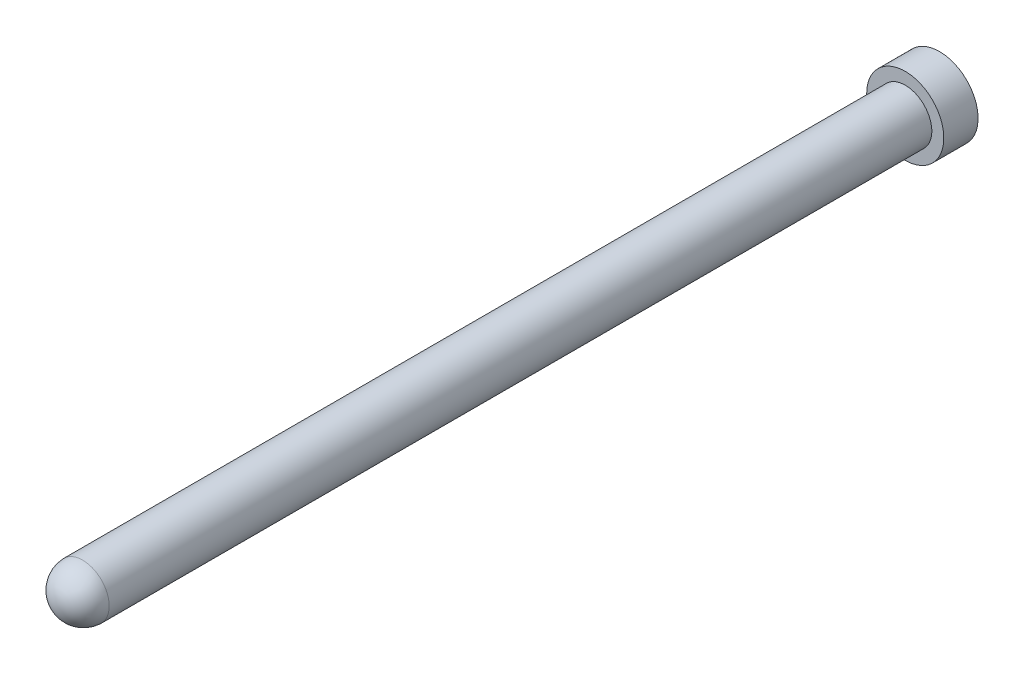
ISO-10303-21;
HEADER;
FILE_DESCRIPTION(('STEP AP214'),'2;1');
FILE_NAME('part.step','',(''),(''),'','','');
FILE_SCHEMA(('AUTOMOTIVE_DESIGN { 1 0 10303 214 1 1 1 1 }'));
ENDSEC;
DATA;
#1=APPLICATION_CONTEXT('core data for automotive mechanical design processes');
#2=APPLICATION_PROTOCOL_DEFINITION('international standard','automotive_design',2000,#1);
#3=PRODUCT_CONTEXT('',#1,'mechanical');
#4=PRODUCT('Part','Part','',(#3));
#5=PRODUCT_RELATED_PRODUCT_CATEGORY('part','',(#4));
#6=PRODUCT_DEFINITION_FORMATION('','',#4);
#7=PRODUCT_DEFINITION_CONTEXT('part definition',#1,'design');
#8=PRODUCT_DEFINITION('design','',#6,#7);
#9=PRODUCT_DEFINITION_SHAPE('','',#8);
#10=(LENGTH_UNIT() NAMED_UNIT(*) SI_UNIT(.MILLI.,.METRE.));
#11=(NAMED_UNIT(*) PLANE_ANGLE_UNIT() SI_UNIT($,.RADIAN.));
#12=(NAMED_UNIT(*) SI_UNIT($,.STERADIAN.) SOLID_ANGLE_UNIT());
#13=UNCERTAINTY_MEASURE_WITH_UNIT(LENGTH_MEASURE(1.E-05),#10,'distance_accuracy_value','');
#14=(GEOMETRIC_REPRESENTATION_CONTEXT(3) GLOBAL_UNCERTAINTY_ASSIGNED_CONTEXT((#13)) GLOBAL_UNIT_ASSIGNED_CONTEXT((#10,
#11,#12)) REPRESENTATION_CONTEXT('',''));
#15=CARTESIAN_POINT('',(0.,0.,0.));
#16=DIRECTION('',(0.,0.,1.));
#17=DIRECTION('',(1.,0.,0.));
#18=AXIS2_PLACEMENT_3D('',#15,#16,#17);
#19=CARTESIAN_POINT('',(0.,0.,100.));
#20=DIRECTION('',(0.,0.,-1.));
#21=DIRECTION('',(-1.00000000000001,0.,0.));
#22=AXIS2_PLACEMENT_3D('',#19,#20,#21);
#23=CYLINDRICAL_SURFACE('',#22,3.1);
#24=CARTESIAN_POINT('',(0.,0.,100.));
#25=DIRECTION('',(0.,0.,1.));
#26=DIRECTION('',(1.00000000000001,0.,0.));
#27=AXIS2_PLACEMENT_3D('',#24,#25,#26);
#28=CIRCLE('',#27,3.1);
#29=CARTESIAN_POINT('',(3.10000000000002,0.,100.));
#30=VERTEX_POINT('',#29);
#31=EDGE_CURVE('E35',#30,#30,#28,.T.);
#32=ORIENTED_EDGE('',*,*,#31,.F.);
#33=EDGE_LOOP('',(#32));
#34=FACE_BOUND('',#33,.T.);
#35=CARTESIAN_POINT('',(0.,0.,4.));
#36=DIRECTION('',(0.,0.,-1.));
#37=DIRECTION('',(-1.00000000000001,0.,0.));
#38=AXIS2_PLACEMENT_3D('',#35,#36,#37);
#39=CIRCLE('',#38,3.1);
#40=CARTESIAN_POINT('',(-3.10000000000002,0.,4.));
#41=VERTEX_POINT('',#40);
#42=EDGE_CURVE('E10',#41,#41,#39,.T.);
#43=ORIENTED_EDGE('',*,*,#42,.F.);
#44=EDGE_LOOP('',(#43));
#45=FACE_BOUND('',#44,.T.);
#46=ADVANCED_FACE('F31',(#34,#45),#23,.T.);
#47=CARTESIAN_POINT('',(0.,0.,99.8983333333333));
#48=DIRECTION('',(0.,0.,1.));
#49=DIRECTION('',(1.00000000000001,0.,0.));
#50=AXIS2_PLACEMENT_3D('',#47,#48,#49);
#51=SPHERICAL_SURFACE('',#50,3.10166666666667);
#52=ORIENTED_EDGE('',*,*,#31,.T.);
#53=EDGE_LOOP('',(#52));
#54=FACE_BOUND('',#53,.T.);
#55=ADVANCED_FACE('F33',(#54),#51,.T.);
#56=CARTESIAN_POINT('',(0.,0.,4.));
#57=DIRECTION('',(0.,0.,-1.));
#58=DIRECTION('',(-1.00000000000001,0.,0.));
#59=AXIS2_PLACEMENT_3D('',#56,#57,#58);
#60=PLANE('',#59);
#61=CARTESIAN_POINT('',(0.,0.,4.));
#62=DIRECTION('',(0.,0.,-1.));
#63=DIRECTION('',(-1.00000000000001,0.,0.));
#64=AXIS2_PLACEMENT_3D('',#61,#62,#63);
#65=CIRCLE('',#64,4.5);
#66=CARTESIAN_POINT('',(-4.50000000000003,0.,4.));
#67=VERTEX_POINT('',#66);
#68=EDGE_CURVE('E42',#67,#67,#65,.T.);
#69=ORIENTED_EDGE('',*,*,#68,.F.);
#70=EDGE_LOOP('',(#69));
#71=FACE_BOUND('',#70,.T.);
#72=ORIENTED_EDGE('',*,*,#42,.T.);
#73=EDGE_LOOP('',(#72));
#74=FACE_BOUND('',#73,.T.);
#75=ADVANCED_FACE('F54',(#71,#74),#60,.F.);
#76=CARTESIAN_POINT('',(0.,0.,4.));
#77=DIRECTION('',(0.,0.,-1.));
#78=DIRECTION('',(-1.00000000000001,0.,0.));
#79=AXIS2_PLACEMENT_3D('',#76,#77,#78);
#80=CYLINDRICAL_SURFACE('',#79,4.5);
#81=ORIENTED_EDGE('',*,*,#68,.T.);
#82=EDGE_LOOP('',(#81));
#83=FACE_BOUND('',#82,.T.);
#84=CARTESIAN_POINT('',(0.,0.,0.));
#85=DIRECTION('',(0.,0.,-1.));
#86=DIRECTION('',(-1.00000000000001,0.,0.));
#87=AXIS2_PLACEMENT_3D('',#84,#85,#86);
#88=CIRCLE('',#87,4.5);
#89=CARTESIAN_POINT('',(-4.50000000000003,0.,0.));
#90=VERTEX_POINT('',#89);
#91=EDGE_CURVE('E46',#90,#90,#88,.T.);
#92=ORIENTED_EDGE('',*,*,#91,.F.);
#93=EDGE_LOOP('',(#92));
#94=FACE_BOUND('',#93,.T.);
#95=ADVANCED_FACE('F52',(#83,#94),#80,.T.);
#96=CARTESIAN_POINT('',(0.,0.,0.));
#97=DIRECTION('',(0.,0.,1.));
#98=DIRECTION('',(1.00000000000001,0.,0.));
#99=AXIS2_PLACEMENT_3D('',#96,#97,#98);
#100=PLANE('',#99);
#101=ORIENTED_EDGE('',*,*,#91,.T.);
#102=EDGE_LOOP('',(#101));
#103=FACE_BOUND('',#102,.T.);
#104=ADVANCED_FACE('F50',(#103),#100,.F.);
#105=CLOSED_SHELL('',(#46,#55,#75,#95,#104));
#106=MANIFOLD_SOLID_BREP('B2',#105);
#107=ADVANCED_BREP_SHAPE_REPRESENTATION('',(#18,#106),#14);
#108=SHAPE_DEFINITION_REPRESENTATION(#9,#107);
ENDSEC;
END-ISO-10303-21;
